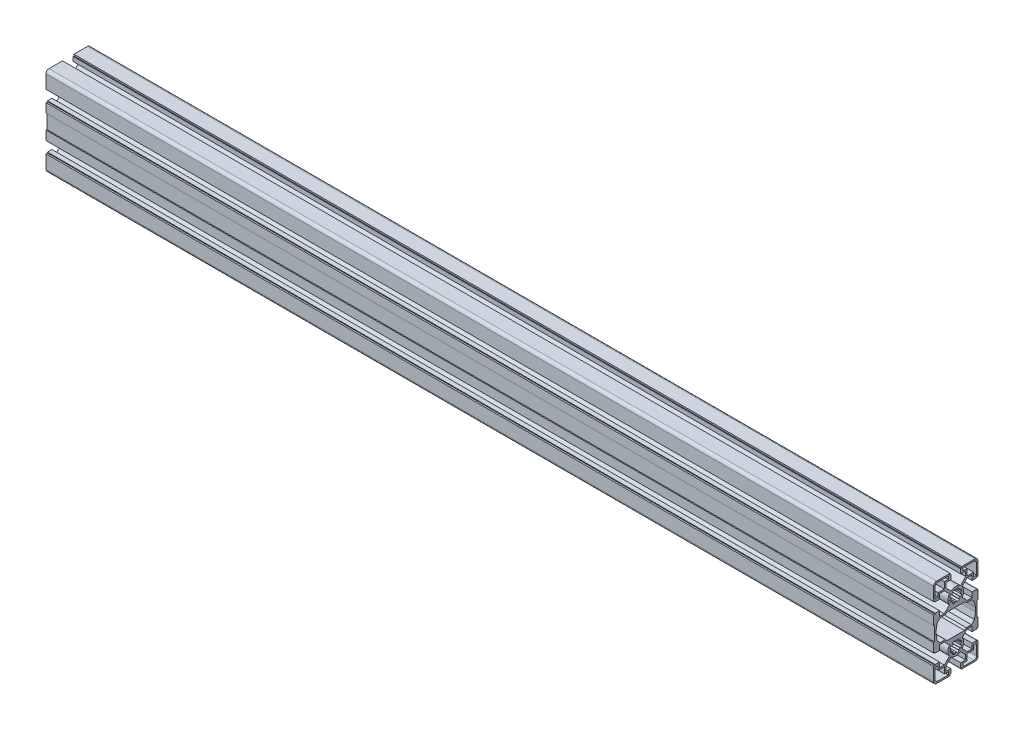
from build123d import *

# Parameters (mm, degrees)
BOSS_EXTRU_1_DEPTH = 450


with BuildPart() as part:
    # Esquisse1 → Boss.-Extru.1 (new, symmetric)
    with BuildSketch(Plane(origin=(0, 0, 0), x_dir=(0, 0, -1), z_dir=(1, 0, 0))):
        with BuildLine():
            Line((-20.999999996, 27.500000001), (-16.499999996, 27.500000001))
            Line((-16.499999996, 27.500000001), (-16.499999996, 32.550000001))
            Line((-16.499999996, 32.550000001), (-11.699999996, 32.550000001))
            Line((-11.699999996, 32.550000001), (-6.421371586, 27.271371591))
            ThreePointArc((-6.421371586, 27.271371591), (-7.999999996, 22.500000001), (-6.421371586, 17.728628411))
            Line((-6.421371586, 17.728628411), (-11.699999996, 12.450000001))
            Line((-11.699999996, 12.450000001), (-16.499999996, 12.450000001))
            Line((-16.499999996, 12.450000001), (-16.499999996, 17.500000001))
            Line((-16.499999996, 17.500000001), (-20.999999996, 17.500000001))
            Line((-20.999999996, 17.500000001), (-20.999999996, 16.700000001))
            Line((-20.999999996, 16.700000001), (-22.499999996, 16.700000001))
            Line((-22.499999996, 16.700000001), (-22.499999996, 7.500000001))
            Line((-22.499999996, 7.500000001), (-21.499999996, 7.500000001))
            Line((-21.499999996, 7.500000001), (-21.499999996, -7.499999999))
            Line((-21.499999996, -7.499999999), (-22.499999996, -7.499999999))
            Line((-22.499999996, -7.499999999), (-22.499999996, -16.699999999))
            Line((-22.499999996, -16.699999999), (-20.999999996, -16.699999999))
            Line((-20.999999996, -16.699999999), (-20.999999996, -17.499999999))
            Line((-20.999999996, -17.499999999), (-16.499999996, -17.499999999))
            Line((-16.499999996, -17.499999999), (-16.499999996, -12.449999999))
            Line((-16.499999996, -12.449999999), (-11.699999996, -12.449999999))
            Line((-11.699999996, -12.449999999), (-6.421371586, -17.728628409))
            ThreePointArc((-6.421371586, -17.728628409), (-7.999999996, -22.499999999), (-6.421371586, -27.271371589))
            Line((-6.421371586, -27.271371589), (-11.699999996, -32.549999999))
            Line((-11.699999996, -32.549999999), (-16.499999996, -32.549999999))
            Line((-16.499999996, -32.549999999), (-16.499999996, -27.499999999))
            Line((-16.499999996, -27.499999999), (-20.999999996, -27.499999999))
            Line((-20.999999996, -27.499999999), (-20.999999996, -28.299999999))
            Line((-20.999999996, -28.299999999), (-22.499999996, -28.299999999))
            Line((-22.499999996, -28.299999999), (-22.499999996, -41.999999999))
            ThreePointArc((-22.499999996, -41.999999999), (-21.621320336, -44.121320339), (-19.499999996, -44.999999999))
            Line((-19.499999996, -44.999999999), (-5.799999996, -44.999999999))
            Line((-5.799999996, -44.999999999), (-5.799999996, -43.499999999))
            Line((-5.799999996, -43.499999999), (-4.999999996, -43.499999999))
            Line((-4.999999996, -43.499999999), (-4.999999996, -38.999999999))
            Line((-4.999999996, -38.999999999), (-10.049999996, -38.999999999))
            Line((-10.049999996, -38.999999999), (-10.049999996, -34.199999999))
            Line((-10.049999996, -34.199999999), (-4.771371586, -28.921371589))
            ThreePointArc((-4.771371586, -28.921371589), (4e-09, -30.499999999), (4.771371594, -28.921371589))
            Line((4.771371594, -28.921371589), (10.050000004, -34.199999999))
            Line((10.050000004, -34.199999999), (10.050000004, -38.999999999))
            Line((10.050000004, -38.999999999), (5.000000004, -38.999999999))
            Line((5.000000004, -38.999999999), (5.000000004, -43.499999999))
            Line((5.000000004, -43.499999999), (5.800000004, -43.499999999))
            Line((5.800000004, -43.499999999), (5.800000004, -44.999999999))
            Line((5.800000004, -44.999999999), (19.500000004, -44.999999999))
            ThreePointArc((19.500000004, -44.999999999), (21.621320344, -44.121320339), (22.500000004, -41.999999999))
            Line((22.500000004, -41.999999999), (22.500000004, -28.3))
            Line((22.500000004, -28.3), (20.999999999, -28.3))
            Line((20.999999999, -28.3), (20.999999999, -27.5))
            Line((20.999999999, -27.5), (16.499999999, -27.5))
            Line((16.499999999, -27.5), (16.499999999, -32.55))
            Line((16.499999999, -32.55), (11.699999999, -32.55))
            Line((11.699999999, -32.55), (6.421371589, -27.27137159))
            ThreePointArc((6.421371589, -27.27137159), (7.999999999, -22.5), (6.421371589, -17.72862841))
            Line((6.421371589, -17.72862841), (11.699999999, -12.45))
            Line((11.699999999, -12.45), (16.499999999, -12.45))
            Line((16.499999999, -12.45), (16.499999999, -17.5))
            Line((16.499999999, -17.5), (20.999999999, -17.5))
            Line((20.999999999, -17.5), (20.999999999, -16.7))
            Line((20.999999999, -16.7), (22.499999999, -16.7))
            Line((22.499999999, -16.7), (22.499999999, -7.5))
            Line((22.499999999, -7.5), (21.499999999, -7.5))
            Line((21.499999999, -7.5), (21.499999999, 7.5))
            Line((21.499999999, 7.5), (22.499999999, 7.5))
            Line((22.499999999, 7.5), (22.499999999, 16.7))
            Line((22.499999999, 16.7), (20.999999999, 16.7))
            Line((20.999999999, 16.7), (20.999999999, 17.5))
            Line((20.999999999, 17.5), (16.499999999, 17.5))
            Line((16.499999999, 17.5), (16.499999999, 12.45))
            Line((16.499999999, 12.45), (11.699999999, 12.45))
            Line((11.699999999, 12.45), (6.421371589, 17.72862841))
            ThreePointArc((6.421371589, 17.72862841), (7.999999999, 22.5), (6.421371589, 27.27137159))
            Line((6.421371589, 27.27137159), (11.699999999, 32.55))
            Line((11.699999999, 32.55), (16.499999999, 32.55))
            Line((16.499999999, 32.55), (16.499999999, 27.5))
            Line((16.499999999, 27.5), (20.999999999, 27.5))
            Line((20.999999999, 27.5), (20.999999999, 28.3))
            Line((20.999999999, 28.3), (22.500000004, 28.3))
            Line((22.500000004, 28.3), (22.500000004, 42.000000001))
            ThreePointArc((22.500000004, 42.000000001), (21.62132034, 44.121320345), (19.499999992, 45.000000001))
            Line((19.499999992, 45.000000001), (5.800000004, 45.000000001))
            Line((5.800000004, 45.000000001), (5.800000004, 43.500000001))
            Line((5.800000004, 43.500000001), (5.000000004, 43.500000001))
            Line((5.000000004, 43.500000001), (5.000000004, 39.000000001))
            Line((5.000000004, 39.000000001), (10.050000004, 39.000000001))
            Line((10.050000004, 39.000000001), (10.050000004, 34.200000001))
            Line((10.050000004, 34.200000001), (4.771371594, 28.921371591))
            ThreePointArc((4.771371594, 28.921371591), (4e-09, 30.500000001), (-4.771371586, 28.921371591))
            Line((-4.771371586, 28.921371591), (-10.049999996, 34.200000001))
            Line((-10.049999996, 34.200000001), (-10.049999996, 39.000000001))
            Line((-10.049999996, 39.000000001), (-4.999999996, 39.000000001))
            Line((-4.999999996, 39.000000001), (-4.999999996, 43.500000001))
            Line((-4.999999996, 43.500000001), (-5.799999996, 43.500000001))
            Line((-5.799999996, 43.500000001), (-5.799999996, 45.000000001))
            Line((-5.799999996, 45.000000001), (-19.499999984, 45.000000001))
            ThreePointArc((-19.499999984, 45.000000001), (-21.621320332, 44.121320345), (-22.499999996, 42.000000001))
            Line((-22.499999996, 42.000000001), (-22.499999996, 28.300000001))
            Line((-22.499999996, 28.300000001), (-20.999999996, 28.300000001))
            Line((-20.999999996, 28.300000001), (-20.999999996, 27.500000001))
        make_face()
        with BuildLine():
            Line((-7.5, 40.5), (-7.5, 43.5))
            Line((-7.5, 43.5), (-18.499999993, 43.5))
            ThreePointArc((-18.499999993, 43.5), (-20.267766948, 42.767766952), (-21, 41))
            Line((-21, 41), (-21, 30))
            Line((-21, 30), (-18, 30))
            Line((-18, 30), (-18, 34.05))
            Line((-18, 34.05), (-11.55, 34.05))
            Line((-11.55, 34.05), (-11.55, 40.5))
            Line((-11.55, 40.5), (-7.5, 40.5))
        make_face(mode=Mode.SUBTRACT)
        with BuildLine():
            Line((18.49999999, 43.5), (7.5, 43.5))
            Line((7.5, 43.5), (7.5, 40.5))
            Line((7.5, 40.5), (11.55, 40.5))
            Line((11.55, 40.5), (11.55, 34.05))
            Line((11.55, 34.05), (18, 34.05))
            Line((18, 34.05), (18, 30))
            Line((18, 30), (21, 30))
            Line((21, 30), (21, 41))
            ThreePointArc((21, 41), (20.267766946, 42.767766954), (18.49999999, 43.5))
        make_face(mode=Mode.SUBTRACT)
        with BuildLine():
            Line((1.059253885, 28.507327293), (0.868240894, 27.424038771))
            ThreePointArc((0.868240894, 27.424038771), (4e-09, 27.500000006), (-0.868240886, 27.424038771))
            Line((-0.868240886, 27.424038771), (-1.059253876, 28.507327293))
            ThreePointArc((-1.059253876, 28.507327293), (-2.33436893, 28.135665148), (-3.498816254, 27.496827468))
            Line((-3.498816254, 27.496827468), (-2.867882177, 26.595760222))
            ThreePointArc((-2.867882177, 26.595760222), (-3.5355339, 26.035533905), (-4.095760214, 25.36788218))
            Line((-4.095760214, 25.36788218), (-4.996827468, 25.998816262))
            ThreePointArc((-4.996827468, 25.998816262), (-5.635665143, 24.834368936), (-6.007327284, 23.55925388))
            Line((-6.007327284, 23.55925388), (-4.924038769, 23.368240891))
            ThreePointArc((-4.924038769, 23.368240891), (-5.000000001, 22.500000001), (-4.924038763, 21.631759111))
            Line((-4.924038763, 21.631759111), (-6.007327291, 21.44074612))
            ThreePointArc((-6.007327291, 21.44074612), (-5.635665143, 20.165631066), (-4.996827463, 19.001183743))
            Line((-4.996827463, 19.001183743), (-4.095760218, 19.63211782))
            ThreePointArc((-4.095760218, 19.63211782), (-3.5355339, 18.964466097), (-2.867882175, 18.404239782))
            Line((-2.867882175, 18.404239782), (-3.498816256, 17.503172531))
            ThreePointArc((-3.498816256, 17.503172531), (-2.33436893, 16.864334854), (-1.059253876, 16.492672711))
            Line((-1.059253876, 16.492672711), (-0.868240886, 17.575961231))
            ThreePointArc((-0.868240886, 17.575961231), (-4e-09, 17.499999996), (0.868240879, 17.575961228))
            Line((0.868240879, 17.575961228), (1.059253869, 16.492672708))
            ThreePointArc((1.059253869, 16.492672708), (2.334368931, 16.864334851), (3.498816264, 17.503172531))
            Line((3.498816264, 17.503172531), (2.867882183, 18.404239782))
            ThreePointArc((2.867882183, 18.404239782), (3.535533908, 18.964466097), (4.095760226, 19.63211782))
            Line((4.095760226, 19.63211782), (4.99682747, 19.001183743))
            ThreePointArc((4.99682747, 19.001183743), (5.635665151, 20.165631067), (6.007327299, 21.44074612))
            Line((6.007327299, 21.44074612), (4.924038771, 21.631759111))
            ThreePointArc((4.924038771, 21.631759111), (5.000000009, 22.500000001), (4.924038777, 23.368240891))
            Line((4.924038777, 23.368240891), (6.007327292, 23.55925388))
            ThreePointArc((6.007327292, 23.55925388), (5.635665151, 24.834368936), (4.996827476, 25.998816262))
            Line((4.996827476, 25.998816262), (4.095760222, 25.36788218))
            ThreePointArc((4.095760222, 25.36788218), (3.535533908, 26.035533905), (2.867882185, 26.595760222))
            Line((2.867882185, 26.595760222), (3.498816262, 27.496827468))
            ThreePointArc((3.498816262, 27.496827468), (2.334368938, 28.135665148), (1.059253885, 28.507327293))
        make_face(mode=Mode.SUBTRACT)
        Polygon((10.614299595, 10.950000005), (8.892850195, 12.500000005), (-8.892850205, 12.500000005), (-10.614299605, 10.950000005), (-15.840508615, 10.950000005), (-18.8417635, 7.94874512), (-20, 1.89642069), (-20, -1.89642069), (-18.8417635, -7.94874512), (-15.840508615, -10.950000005), (-10.614299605, -10.950000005), (-8.892850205, -12.500000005), (8.892850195, -12.500000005), (10.614299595, -10.950000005), (15.840508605, -10.950000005), (18.84176349, -7.94874512), (19.99999999, -1.89642069), (19.99999999, 1.89642069), (18.84176349, 7.94874512), (15.840508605, 10.950000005), align=None, mode=Mode.SUBTRACT)
        with BuildLine():
            Line((-21, -30), (-21, -41))
            ThreePointArc((-21, -41), (-20.267766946, -42.767766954), (-18.49999999, -43.5))
            Line((-18.49999999, -43.5), (-7.5, -43.5))
            Line((-7.5, -43.5), (-7.5, -40.5))
            Line((-7.5, -40.5), (-11.55, -40.5))
            Line((-11.55, -40.5), (-11.55, -34.05))
            Line((-11.55, -34.05), (-18, -34.05))
            Line((-18, -34.05), (-18, -30))
            Line((-18, -30), (-21, -30))
        make_face(mode=Mode.SUBTRACT)
        with BuildLine():
            Line((-2.867882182, -26.595760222), (-3.498816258, -27.496827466))
            ThreePointArc((-3.498816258, -27.496827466), (-2.334368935, -28.135665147), (-1.059253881, -28.507327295))
            Line((-1.059253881, -28.507327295), (-0.86824089, -27.424038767))
            ThreePointArc((-0.86824089, -27.424038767), (0, -27.500000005), (0.86824089, -27.424038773))
            Line((0.86824089, -27.424038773), (1.059253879, -28.507327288))
            ThreePointArc((1.059253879, -28.507327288), (2.334368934, -28.135665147), (3.49881626, -27.496827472))
            Line((3.49881626, -27.496827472), (2.867882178, -26.595760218))
            ThreePointArc((2.867882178, -26.595760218), (3.535533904, -26.035533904), (4.095760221, -25.367882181))
            Line((4.095760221, -25.367882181), (4.996827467, -25.998816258))
            ThreePointArc((4.996827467, -25.998816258), (5.635665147, -24.834368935), (6.007327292, -23.559253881))
            Line((6.007327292, -23.559253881), (4.924038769, -23.36824089))
            ThreePointArc((4.924038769, -23.36824089), (5.000000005, -22.5), (4.924038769, -21.63175911))
            Line((4.924038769, -21.63175911), (6.007327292, -21.44074612))
            ThreePointArc((6.007327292, -21.44074612), (5.635665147, -20.165631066), (4.996827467, -19.001183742))
            Line((4.996827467, -19.001183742), (4.095760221, -19.632117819))
            ThreePointArc((4.095760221, -19.632117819), (3.535533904, -18.964466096), (2.867882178, -18.404239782))
            Line((2.867882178, -18.404239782), (3.49881626, -17.503172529))
            ThreePointArc((3.49881626, -17.503172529), (2.334368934, -16.864334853), (1.059253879, -16.492672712))
            Line((1.059253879, -16.492672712), (0.86824089, -17.575961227))
            ThreePointArc((0.86824089, -17.575961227), (0, -17.499999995), (-0.86824089, -17.575961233))
            Line((-0.86824089, -17.575961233), (-1.059253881, -16.492672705))
            ThreePointArc((-1.059253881, -16.492672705), (-2.334368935, -16.864334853), (-3.498816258, -17.503172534))
            Line((-3.498816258, -17.503172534), (-2.867882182, -18.404239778))
            ThreePointArc((-2.867882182, -18.404239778), (-3.535533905, -18.964466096), (-4.095760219, -19.632117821))
            Line((-4.095760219, -19.632117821), (-4.996827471, -19.00118374))
            ThreePointArc((-4.996827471, -19.00118374), (-5.635665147, -20.165631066), (-6.007327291, -21.44074612))
            Line((-6.007327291, -21.44074612), (-4.924038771, -21.63175911))
            ThreePointArc((-4.924038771, -21.63175911), (-5.000000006, -22.5), (-4.924038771, -23.36824089))
            Line((-4.924038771, -23.36824089), (-6.007327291, -23.55925388))
            ThreePointArc((-6.007327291, -23.55925388), (-5.635665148, -24.834368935), (-4.996827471, -25.99881626))
            Line((-4.996827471, -25.99881626), (-4.095760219, -25.367882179))
            ThreePointArc((-4.095760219, -25.367882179), (-3.535533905, -26.035533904), (-2.867882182, -26.595760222))
        make_face(mode=Mode.SUBTRACT)
        with BuildLine():
            Line((21, -41), (21, -30))
            Line((21, -30), (18, -30))
            Line((18, -30), (18, -34.05))
            Line((18, -34.05), (11.55, -34.05))
            Line((11.55, -34.05), (11.55, -40.5))
            Line((11.55, -40.5), (7.5, -40.5))
            Line((7.5, -40.5), (7.5, -43.5))
            Line((7.5, -43.5), (18.499999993, -43.5))
            ThreePointArc((18.499999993, -43.5), (20.267766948, -42.767766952), (21, -41))
        make_face(mode=Mode.SUBTRACT)
    extrude(amount=BOSS_EXTRU_1_DEPTH, both=True)


solid = part.part
